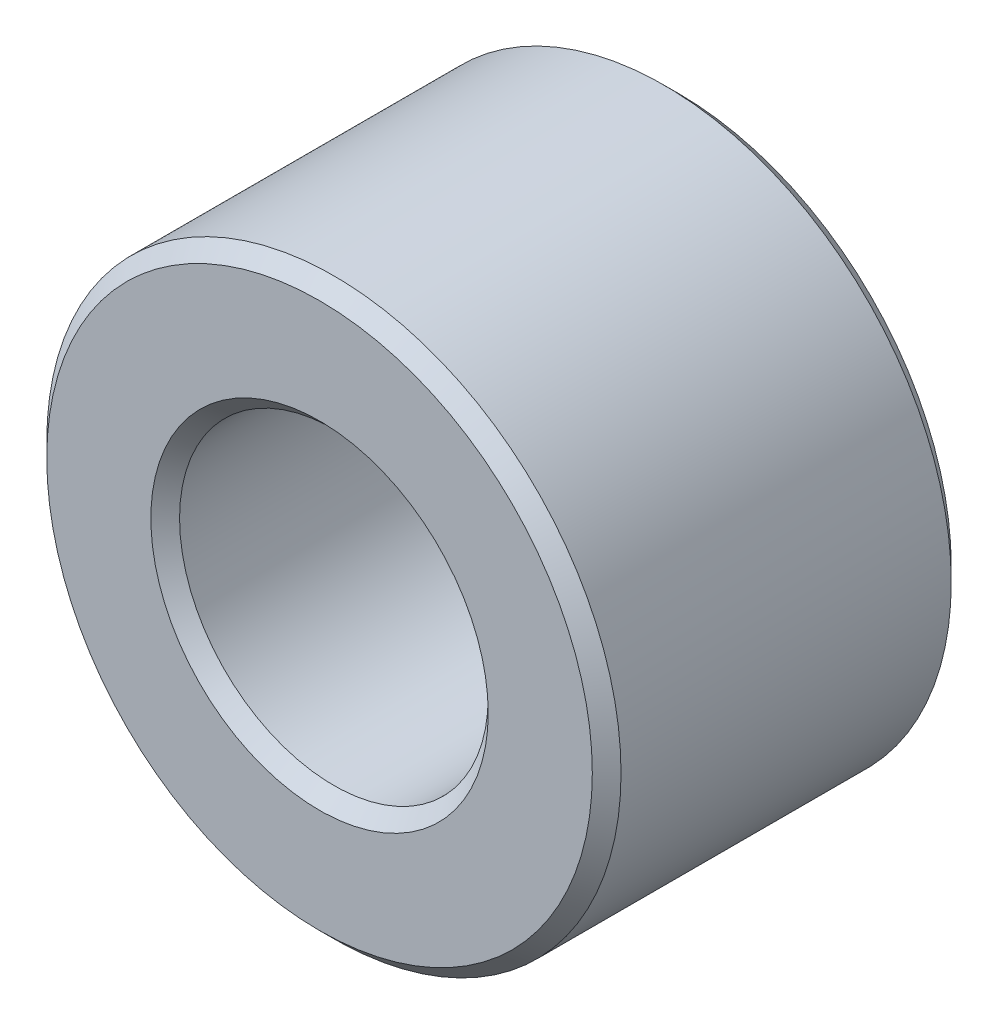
from build123d import *

# Parameters (mm, degrees)
SKETCH1_R           = 4
SKETCH1_R_2         = 2.15
BOSS_EXTRUDE2_DEPTH = 2.5
CHAMFER3_SIZE       = 0.2


with BuildPart() as part:
    # Sketch1 → Boss-Extrude2 (new, symmetric)
    with BuildSketch(Plane.XY):
        Circle(SKETCH1_R)
        Circle(SKETCH1_R_2, mode=Mode.SUBTRACT)
    extrude(amount=BOSS_EXTRUDE2_DEPTH, both=True)

    # Chamfer3
    chamfer3_edges = [part.edges().sort_by_distance(p)[0] for p in [
        (-4, 0, -2.5),
        (-4, 0, 2.5),
        (-2.15, 0, -2.5),
        (-2.15, 0, 2.5),
    ]]
    chamfer(chamfer3_edges, length=CHAMFER3_SIZE)


solid = part.part
